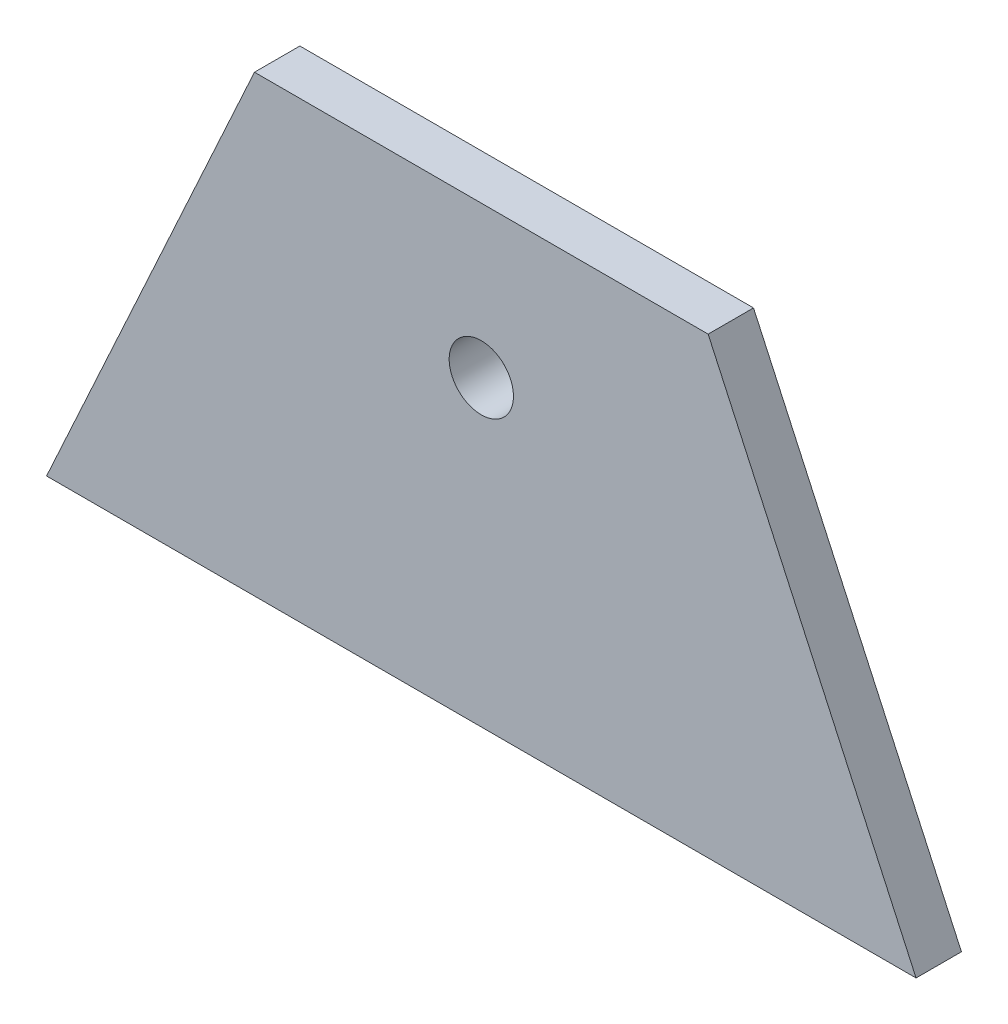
from build123d import *

# Parameters (mm, degrees)
ESQUISSE1_R          = 8.5
BASE_EXTRUSION_DEPTH = 12


with BuildPart() as part:
    # Esquisse1 → Base-Extrusion (new body)
    with BuildSketch(Plane.XY):
        Polygon((0, 0), (230, 0), (175, 120), (55, 120), align=None)
        with Locations((115, 80)):
            Circle(ESQUISSE1_R, mode=Mode.SUBTRACT)
    extrude(amount=BASE_EXTRUSION_DEPTH)


solid = part.part
